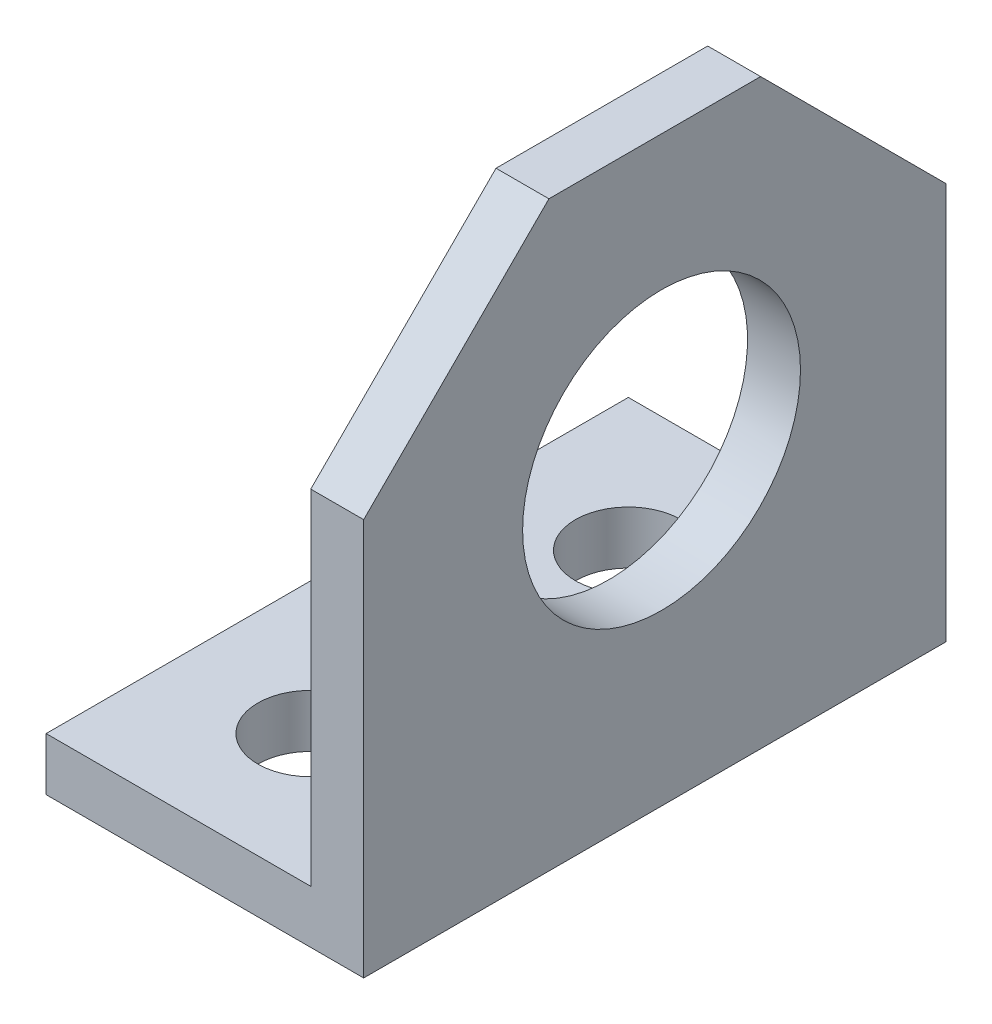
ISO-10303-21;
HEADER;
FILE_DESCRIPTION(('STEP AP214'),'2;1');
FILE_NAME('part.step','',(''),(''),'','','');
FILE_SCHEMA(('AUTOMOTIVE_DESIGN { 1 0 10303 214 1 1 1 1 }'));
ENDSEC;
DATA;
#1=APPLICATION_CONTEXT('core data for automotive mechanical design processes');
#2=APPLICATION_PROTOCOL_DEFINITION('international standard','automotive_design',2000,#1);
#3=PRODUCT_CONTEXT('',#1,'mechanical');
#4=PRODUCT('Part','Part','',(#3));
#5=PRODUCT_RELATED_PRODUCT_CATEGORY('part','',(#4));
#6=PRODUCT_DEFINITION_FORMATION('','',#4);
#7=PRODUCT_DEFINITION_CONTEXT('part definition',#1,'design');
#8=PRODUCT_DEFINITION('design','',#6,#7);
#9=PRODUCT_DEFINITION_SHAPE('','',#8);
#10=(LENGTH_UNIT() NAMED_UNIT(*) SI_UNIT(.MILLI.,.METRE.));
#11=(NAMED_UNIT(*) PLANE_ANGLE_UNIT() SI_UNIT($,.RADIAN.));
#12=(NAMED_UNIT(*) SI_UNIT($,.STERADIAN.) SOLID_ANGLE_UNIT());
#13=UNCERTAINTY_MEASURE_WITH_UNIT(LENGTH_MEASURE(1.E-05),#10,'distance_accuracy_value','');
#14=(GEOMETRIC_REPRESENTATION_CONTEXT(3) GLOBAL_UNCERTAINTY_ASSIGNED_CONTEXT((#13)) GLOBAL_UNIT_ASSIGNED_CONTEXT((#10,
#11,#12)) REPRESENTATION_CONTEXT('',''));
#15=CARTESIAN_POINT('',(0.,0.,0.));
#16=DIRECTION('',(0.,0.,1.));
#17=DIRECTION('',(1.,0.,0.));
#18=AXIS2_PLACEMENT_3D('',#15,#16,#17);
#19=CARTESIAN_POINT('',(0.,2.,11.));
#20=DIRECTION('',(0.,-1.,0.));
#21=DIRECTION('',(1.,0.,0.));
#22=AXIS2_PLACEMENT_3D('',#19,#20,#21);
#23=PLANE('',#22);
#24=CARTESIAN_POINT('',(-7.,2.,6.));
#25=DIRECTION('',(0.,1.,0.));
#26=DIRECTION('',(-1.,0.,0.));
#27=AXIS2_PLACEMENT_3D('',#24,#25,#26);
#28=CIRCLE('',#27,2.);
#29=CARTESIAN_POINT('',(-9.,2.,6.));
#30=VERTEX_POINT('',#29);
#31=EDGE_CURVE('E173',#30,#30,#28,.T.);
#32=ORIENTED_EDGE('',*,*,#31,.F.);
#33=EDGE_LOOP('',(#32));
#34=FACE_BOUND('',#33,.T.);
#35=CARTESIAN_POINT('',(-7.,2.,-6.));
#36=DIRECTION('',(0.,1.,0.));
#37=DIRECTION('',(-1.,0.,0.));
#38=AXIS2_PLACEMENT_3D('',#35,#36,#37);
#39=CIRCLE('',#38,2.);
#40=CARTESIAN_POINT('',(-9.,2.,-6.));
#41=VERTEX_POINT('',#40);
#42=EDGE_CURVE('E166',#41,#41,#39,.T.);
#43=ORIENTED_EDGE('',*,*,#42,.F.);
#44=EDGE_LOOP('',(#43));
#45=FACE_BOUND('',#44,.T.);
#46=DIRECTION('',(-1.,0.,0.));
#47=VECTOR('',#46,1.);
#48=CARTESIAN_POINT('',(0.,2.,-11.));
#49=LINE('',#48,#47);
#50=CARTESIAN_POINT('',(-2.,2.,-11.));
#51=VERTEX_POINT('',#50);
#52=CARTESIAN_POINT('',(-12.,2.,-11.));
#53=VERTEX_POINT('',#52);
#54=EDGE_CURVE('E117',#51,#53,#49,.T.);
#55=ORIENTED_EDGE('',*,*,#54,.T.);
#56=DIRECTION('',(0.,0.,-1.));
#57=VECTOR('',#56,1.);
#58=CARTESIAN_POINT('',(-12.,2.,11.));
#59=LINE('',#58,#57);
#60=CARTESIAN_POINT('',(-12.,2.,11.));
#61=VERTEX_POINT('',#60);
#62=EDGE_CURVE('E115',#61,#53,#59,.T.);
#63=ORIENTED_EDGE('',*,*,#62,.F.);
#64=DIRECTION('',(-1.,0.,0.));
#65=VECTOR('',#64,1.);
#66=CARTESIAN_POINT('',(0.,2.,11.));
#67=LINE('',#66,#65);
#68=CARTESIAN_POINT('',(-2.,2.,11.));
#69=VERTEX_POINT('',#68);
#70=EDGE_CURVE('E101',#69,#61,#67,.T.);
#71=ORIENTED_EDGE('',*,*,#70,.F.);
#72=DIRECTION('',(0.,0.,-1.));
#73=VECTOR('',#72,1.);
#74=CARTESIAN_POINT('',(-2.,2.,11.));
#75=LINE('',#74,#73);
#76=EDGE_CURVE('E133',#69,#51,#75,.T.);
#77=ORIENTED_EDGE('',*,*,#76,.T.);
#78=EDGE_LOOP('',(#55,#63,#71,#77));
#79=FACE_BOUND('',#78,.T.);
#80=ADVANCED_FACE('F34',(#34,#45,#79),#23,.F.);
#81=CARTESIAN_POINT('',(-12.,0.,11.));
#82=DIRECTION('',(-1.,0.,0.));
#83=DIRECTION('',(0.,0.,1.));
#84=AXIS2_PLACEMENT_3D('',#81,#82,#83);
#85=PLANE('',#84);
#86=DIRECTION('',(0.,1.,0.));
#87=VECTOR('',#86,1.);
#88=CARTESIAN_POINT('',(-12.,0.,-11.));
#89=LINE('',#88,#87);
#90=CARTESIAN_POINT('',(-12.,0.,-11.));
#91=VERTEX_POINT('',#90);
#92=EDGE_CURVE('E135',#91,#53,#89,.T.);
#93=ORIENTED_EDGE('',*,*,#92,.F.);
#94=DIRECTION('',(0.,0.,-1.));
#95=VECTOR('',#94,1.);
#96=CARTESIAN_POINT('',(-12.,0.,11.));
#97=LINE('',#96,#95);
#98=CARTESIAN_POINT('',(-12.,0.,11.));
#99=VERTEX_POINT('',#98);
#100=EDGE_CURVE('E122',#99,#91,#97,.T.);
#101=ORIENTED_EDGE('',*,*,#100,.F.);
#102=DIRECTION('',(0.,1.,0.));
#103=VECTOR('',#102,1.);
#104=CARTESIAN_POINT('',(-12.,0.,11.));
#105=LINE('',#104,#103);
#106=EDGE_CURVE('E106',#99,#61,#105,.T.);
#107=ORIENTED_EDGE('',*,*,#106,.T.);
#108=ORIENTED_EDGE('',*,*,#62,.T.);
#109=EDGE_LOOP('',(#93,#101,#107,#108));
#110=FACE_BOUND('',#109,.T.);
#111=ADVANCED_FACE('F124',(#110),#85,.T.);
#112=CARTESIAN_POINT('',(0.,0.,11.));
#113=DIRECTION('',(0.,-1.,0.));
#114=DIRECTION('',(1.,0.,0.));
#115=AXIS2_PLACEMENT_3D('',#112,#113,#114);
#116=PLANE('',#115);
#117=CARTESIAN_POINT('',(-7.,0.,6.));
#118=DIRECTION('',(0.,-1.,0.));
#119=DIRECTION('',(1.,0.,0.));
#120=AXIS2_PLACEMENT_3D('',#117,#118,#119);
#121=CIRCLE('',#120,2.);
#122=CARTESIAN_POINT('',(-9.,0.,6.));
#123=VERTEX_POINT('',#122);
#124=EDGE_CURVE('E38',#123,#123,#121,.T.);
#125=ORIENTED_EDGE('',*,*,#124,.F.);
#126=EDGE_LOOP('',(#125));
#127=FACE_BOUND('',#126,.T.);
#128=CARTESIAN_POINT('',(-7.,0.,-6.));
#129=DIRECTION('',(0.,-1.,0.));
#130=DIRECTION('',(1.,0.,0.));
#131=AXIS2_PLACEMENT_3D('',#128,#129,#130);
#132=CIRCLE('',#131,2.);
#133=CARTESIAN_POINT('',(-9.,0.,-6.));
#134=VERTEX_POINT('',#133);
#135=EDGE_CURVE('E136',#134,#134,#132,.T.);
#136=ORIENTED_EDGE('',*,*,#135,.F.);
#137=EDGE_LOOP('',(#136));
#138=FACE_BOUND('',#137,.T.);
#139=DIRECTION('',(-1.,0.,0.));
#140=VECTOR('',#139,1.);
#141=CARTESIAN_POINT('',(0.,0.,-11.));
#142=LINE('',#141,#140);
#143=CARTESIAN_POINT('',(0.,0.,-11.));
#144=VERTEX_POINT('',#143);
#145=EDGE_CURVE('E138',#144,#91,#142,.T.);
#146=ORIENTED_EDGE('',*,*,#145,.F.);
#147=DIRECTION('',(0.,0.,-1.));
#148=VECTOR('',#147,1.);
#149=CARTESIAN_POINT('',(0.,0.,11.));
#150=LINE('',#149,#148);
#151=CARTESIAN_POINT('',(0.,0.,11.));
#152=VERTEX_POINT('',#151);
#153=EDGE_CURVE('E149',#152,#144,#150,.T.);
#154=ORIENTED_EDGE('',*,*,#153,.F.);
#155=DIRECTION('',(-1.,0.,0.));
#156=VECTOR('',#155,1.);
#157=CARTESIAN_POINT('',(0.,0.,11.));
#158=LINE('',#157,#156);
#159=EDGE_CURVE('E125',#152,#99,#158,.T.);
#160=ORIENTED_EDGE('',*,*,#159,.T.);
#161=ORIENTED_EDGE('',*,*,#100,.T.);
#162=EDGE_LOOP('',(#146,#154,#160,#161));
#163=FACE_BOUND('',#162,.T.);
#164=ADVANCED_FACE('F207',(#127,#138,#163),#116,.T.);
#165=CARTESIAN_POINT('',(0.,0.,11.));
#166=DIRECTION('',(1.,0.,0.));
#167=DIRECTION('',(0.,0.,-1.));
#168=AXIS2_PLACEMENT_3D('',#165,#166,#167);
#169=PLANE('',#168);
#170=CARTESIAN_POINT('',(0.,11.64843331,-0.255547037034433));
#171=DIRECTION('',(1.,0.,0.));
#172=DIRECTION('',(0.,0.,-1.));
#173=AXIS2_PLACEMENT_3D('',#170,#171,#172);
#174=CIRCLE('',#173,5.25);
#175=CARTESIAN_POINT('',(0.,11.64843331,-5.50554703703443));
#176=VERTEX_POINT('',#175);
#177=EDGE_CURVE('E177',#176,#176,#174,.T.);
#178=ORIENTED_EDGE('',*,*,#177,.F.);
#179=EDGE_LOOP('',(#178));
#180=FACE_BOUND('',#179,.T.);
#181=DIRECTION('',(0.,-1.,0.));
#182=VECTOR('',#181,1.);
#183=CARTESIAN_POINT('',(0.,0.,-11.));
#184=LINE('',#183,#182);
#185=CARTESIAN_POINT('',(0.,15.,-11.));
#186=VERTEX_POINT('',#185);
#187=EDGE_CURVE('E141',#186,#144,#184,.T.);
#188=ORIENTED_EDGE('',*,*,#187,.F.);
#189=DIRECTION('',(0.,-0.707106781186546,-0.707106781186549));
#190=VECTOR('',#189,1.);
#191=CARTESIAN_POINT('',(0.,18.5,-7.49999999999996));
#192=LINE('',#191,#190);
#193=CARTESIAN_POINT('',(0.,22.,-3.99999999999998));
#194=VERTEX_POINT('',#193);
#195=EDGE_CURVE('E157',#186,#194,#192,.F.);
#196=ORIENTED_EDGE('',*,*,#195,.T.);
#197=DIRECTION('',(0.,0.,-1.));
#198=VECTOR('',#197,1.);
#199=CARTESIAN_POINT('',(0.,22.,11.));
#200=LINE('',#199,#198);
#201=CARTESIAN_POINT('',(0.,22.,4.00000000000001));
#202=VERTEX_POINT('',#201);
#203=EDGE_CURVE('E147',#202,#194,#200,.T.);
#204=ORIENTED_EDGE('',*,*,#203,.F.);
#205=DIRECTION('',(0.,-0.707106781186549,0.707106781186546));
#206=VECTOR('',#205,1.);
#207=CARTESIAN_POINT('',(0.,7.49999999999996,18.5));
#208=LINE('',#207,#206);
#209=CARTESIAN_POINT('',(0.,15.,11.));
#210=VERTEX_POINT('',#209);
#211=EDGE_CURVE('E155',#202,#210,#208,.T.);
#212=ORIENTED_EDGE('',*,*,#211,.T.);
#213=DIRECTION('',(0.,-1.,0.));
#214=VECTOR('',#213,1.);
#215=CARTESIAN_POINT('',(0.,0.,11.));
#216=LINE('',#215,#214);
#217=EDGE_CURVE('E127',#210,#152,#216,.T.);
#218=ORIENTED_EDGE('',*,*,#217,.T.);
#219=ORIENTED_EDGE('',*,*,#153,.T.);
#220=EDGE_LOOP('',(#188,#196,#204,#212,#218,#219));
#221=FACE_BOUND('',#220,.T.);
#222=ADVANCED_FACE('F202',(#180,#221),#169,.T.);
#223=CARTESIAN_POINT('',(-2.,22.,11.));
#224=DIRECTION('',(0.,1.,0.));
#225=DIRECTION('',(0.,0.,1.));
#226=AXIS2_PLACEMENT_3D('',#223,#224,#225);
#227=PLANE('',#226);
#228=ORIENTED_EDGE('',*,*,#203,.T.);
#229=DIRECTION('',(-1.,0.,0.));
#230=VECTOR('',#229,1.);
#231=CARTESIAN_POINT('',(-2.,22.,-3.99999999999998));
#232=LINE('',#231,#230);
#233=CARTESIAN_POINT('',(-2.,22.,-3.99999999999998));
#234=VERTEX_POINT('',#233);
#235=EDGE_CURVE('E57',#194,#234,#232,.T.);
#236=ORIENTED_EDGE('',*,*,#235,.T.);
#237=DIRECTION('',(0.,0.,-1.));
#238=VECTOR('',#237,1.);
#239=CARTESIAN_POINT('',(-2.,22.,11.));
#240=LINE('',#239,#238);
#241=CARTESIAN_POINT('',(-2.,22.,4.00000000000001));
#242=VERTEX_POINT('',#241);
#243=EDGE_CURVE('E145',#242,#234,#240,.T.);
#244=ORIENTED_EDGE('',*,*,#243,.F.);
#245=DIRECTION('',(1.,0.,0.));
#246=VECTOR('',#245,1.);
#247=CARTESIAN_POINT('',(0.,22.,4.));
#248=LINE('',#247,#246);
#249=EDGE_CURVE('E159',#242,#202,#248,.T.);
#250=ORIENTED_EDGE('',*,*,#249,.T.);
#251=EDGE_LOOP('',(#228,#236,#244,#250));
#252=FACE_BOUND('',#251,.T.);
#253=ADVANCED_FACE('F189',(#252),#227,.T.);
#254=CARTESIAN_POINT('',(-2.,0.,11.));
#255=DIRECTION('',(1.,0.,0.));
#256=DIRECTION('',(0.,0.,-1.));
#257=AXIS2_PLACEMENT_3D('',#254,#255,#256);
#258=PLANE('',#257);
#259=CARTESIAN_POINT('',(-2.,11.64843331,-0.255547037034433));
#260=DIRECTION('',(-1.,0.,0.));
#261=DIRECTION('',(0.,0.,1.));
#262=AXIS2_PLACEMENT_3D('',#259,#260,#261);
#263=CIRCLE('',#262,5.25);
#264=CARTESIAN_POINT('',(-2.,11.64843331,4.99445296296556));
#265=VERTEX_POINT('',#264);
#266=EDGE_CURVE('E180',#265,#265,#263,.T.);
#267=ORIENTED_EDGE('',*,*,#266,.F.);
#268=EDGE_LOOP('',(#267));
#269=FACE_BOUND('',#268,.T.);
#270=ORIENTED_EDGE('',*,*,#243,.T.);
#271=DIRECTION('',(0.,0.707106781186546,0.707106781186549));
#272=VECTOR('',#271,1.);
#273=CARTESIAN_POINT('',(-2.,15.,-11.));
#274=LINE('',#273,#272);
#275=CARTESIAN_POINT('',(-2.,15.,-11.));
#276=VERTEX_POINT('',#275);
#277=EDGE_CURVE('E43',#234,#276,#274,.F.);
#278=ORIENTED_EDGE('',*,*,#277,.T.);
#279=DIRECTION('',(0.,1.,0.));
#280=VECTOR('',#279,1.);
#281=CARTESIAN_POINT('',(-2.,0.,-11.));
#282=LINE('',#281,#280);
#283=EDGE_CURVE('E112',#276,#51,#282,.F.);
#284=ORIENTED_EDGE('',*,*,#283,.T.);
#285=ORIENTED_EDGE('',*,*,#76,.F.);
#286=DIRECTION('',(0.,1.,0.));
#287=VECTOR('',#286,1.);
#288=CARTESIAN_POINT('',(-2.,0.,11.));
#289=LINE('',#288,#287);
#290=CARTESIAN_POINT('',(-2.,15.,11.));
#291=VERTEX_POINT('',#290);
#292=EDGE_CURVE('E108',#291,#69,#289,.F.);
#293=ORIENTED_EDGE('',*,*,#292,.F.);
#294=DIRECTION('',(0.,0.707106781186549,-0.707106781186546));
#295=VECTOR('',#294,1.);
#296=CARTESIAN_POINT('',(-2.,22.,4.));
#297=LINE('',#296,#295);
#298=EDGE_CURVE('E163',#291,#242,#297,.T.);
#299=ORIENTED_EDGE('',*,*,#298,.T.);
#300=EDGE_LOOP('',(#270,#278,#284,#285,#293,#299));
#301=FACE_BOUND('',#300,.T.);
#302=ADVANCED_FACE('F186',(#269,#301),#258,.F.);
#303=CARTESIAN_POINT('',(-12.,2.,11.));
#304=DIRECTION('',(0.,0.,-1.));
#305=DIRECTION('',(-1.,0.,0.));
#306=AXIS2_PLACEMENT_3D('',#303,#304,#305);
#307=PLANE('',#306);
#308=ORIENTED_EDGE('',*,*,#217,.F.);
#309=DIRECTION('',(-1.,0.,0.));
#310=VECTOR('',#309,1.);
#311=CARTESIAN_POINT('',(-2.,15.,11.));
#312=LINE('',#311,#310);
#313=EDGE_CURVE('E11',#210,#291,#312,.T.);
#314=ORIENTED_EDGE('',*,*,#313,.T.);
#315=ORIENTED_EDGE('',*,*,#292,.T.);
#316=ORIENTED_EDGE('',*,*,#70,.T.);
#317=ORIENTED_EDGE('',*,*,#106,.F.);
#318=ORIENTED_EDGE('',*,*,#159,.F.);
#319=EDGE_LOOP('',(#308,#314,#315,#316,#317,#318));
#320=FACE_BOUND('',#319,.T.);
#321=ADVANCED_FACE('F103',(#320),#307,.F.);
#322=CARTESIAN_POINT('',(-12.,2.,-11.));
#323=DIRECTION('',(0.,0.,-1.));
#324=DIRECTION('',(-1.,0.,0.));
#325=AXIS2_PLACEMENT_3D('',#322,#323,#324);
#326=PLANE('',#325);
#327=ORIENTED_EDGE('',*,*,#283,.F.);
#328=DIRECTION('',(1.,0.,0.));
#329=VECTOR('',#328,1.);
#330=CARTESIAN_POINT('',(-12.,15.,-11.));
#331=LINE('',#330,#329);
#332=EDGE_CURVE('E121',#276,#186,#331,.T.);
#333=ORIENTED_EDGE('',*,*,#332,.T.);
#334=ORIENTED_EDGE('',*,*,#187,.T.);
#335=ORIENTED_EDGE('',*,*,#145,.T.);
#336=ORIENTED_EDGE('',*,*,#92,.T.);
#337=ORIENTED_EDGE('',*,*,#54,.F.);
#338=EDGE_LOOP('',(#327,#333,#334,#335,#336,#337));
#339=FACE_BOUND('',#338,.T.);
#340=ADVANCED_FACE('F200',(#339),#326,.T.);
#341=CARTESIAN_POINT('',(-12.,15.,-11.));
#342=DIRECTION('',(0.,-0.707106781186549,0.707106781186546));
#343=DIRECTION('',(0.,-0.707106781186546,-0.707106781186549));
#344=AXIS2_PLACEMENT_3D('',#341,#342,#343);
#345=PLANE('',#344);
#346=ORIENTED_EDGE('',*,*,#277,.F.);
#347=ORIENTED_EDGE('',*,*,#235,.F.);
#348=ORIENTED_EDGE('',*,*,#195,.F.);
#349=ORIENTED_EDGE('',*,*,#332,.F.);
#350=EDGE_LOOP('',(#346,#347,#348,#349));
#351=FACE_BOUND('',#350,.T.);
#352=ADVANCED_FACE('F197',(#351),#345,.F.);
#353=CARTESIAN_POINT('',(-2.,22.,4.));
#354=DIRECTION('',(0.,0.707106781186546,0.707106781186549));
#355=DIRECTION('',(0.,-0.707106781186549,0.707106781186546));
#356=AXIS2_PLACEMENT_3D('',#353,#354,#355);
#357=PLANE('',#356);
#358=ORIENTED_EDGE('',*,*,#298,.F.);
#359=ORIENTED_EDGE('',*,*,#313,.F.);
#360=ORIENTED_EDGE('',*,*,#211,.F.);
#361=ORIENTED_EDGE('',*,*,#249,.F.);
#362=EDGE_LOOP('',(#358,#359,#360,#361));
#363=FACE_BOUND('',#362,.T.);
#364=ADVANCED_FACE('F36',(#363),#357,.T.);
#365=CARTESIAN_POINT('',(-7.,-8.5,-6.));
#366=DIRECTION('',(0.,1.,0.));
#367=DIRECTION('',(-1.,0.,0.));
#368=AXIS2_PLACEMENT_3D('',#365,#366,#367);
#369=CYLINDRICAL_SURFACE('',#368,2.);
#370=CARTESIAN_POINT('',(-9.,0.,-6.));
#371=CARTESIAN_POINT('',(-9.,0.0208333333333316,-6.));
#372=CARTESIAN_POINT('',(-9.,0.041666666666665,-6.));
#373=CARTESIAN_POINT('',(-9.,0.0833333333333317,-6.));
#374=CARTESIAN_POINT('',(-9.,0.104166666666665,-6.));
#375=CARTESIAN_POINT('',(-9.,0.145833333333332,-6.));
#376=CARTESIAN_POINT('',(-9.,0.166666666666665,-6.));
#377=CARTESIAN_POINT('',(-9.,0.208333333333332,-6.));
#378=CARTESIAN_POINT('',(-9.,0.229166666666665,-6.));
#379=CARTESIAN_POINT('',(-9.,0.270833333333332,-6.));
#380=CARTESIAN_POINT('',(-9.,0.291666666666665,-6.));
#381=CARTESIAN_POINT('',(-9.,0.333333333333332,-6.));
#382=CARTESIAN_POINT('',(-9.,0.354166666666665,-6.));
#383=CARTESIAN_POINT('',(-9.,0.395833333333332,-6.));
#384=CARTESIAN_POINT('',(-9.,0.416666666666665,-6.));
#385=CARTESIAN_POINT('',(-9.,0.458333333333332,-6.));
#386=CARTESIAN_POINT('',(-9.,0.479166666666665,-6.));
#387=CARTESIAN_POINT('',(-9.,0.520833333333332,-6.));
#388=CARTESIAN_POINT('',(-9.,0.541666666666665,-6.));
#389=CARTESIAN_POINT('',(-9.,0.583333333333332,-6.));
#390=CARTESIAN_POINT('',(-9.,0.604166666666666,-6.));
#391=CARTESIAN_POINT('',(-9.,0.645833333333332,-6.));
#392=CARTESIAN_POINT('',(-9.,0.666666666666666,-6.));
#393=CARTESIAN_POINT('',(-9.,0.708333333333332,-6.));
#394=CARTESIAN_POINT('',(-9.,0.729166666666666,-6.));
#395=CARTESIAN_POINT('',(-9.,0.770833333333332,-6.));
#396=CARTESIAN_POINT('',(-9.,0.791666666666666,-6.));
#397=CARTESIAN_POINT('',(-9.,0.833333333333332,-6.));
#398=CARTESIAN_POINT('',(-9.,0.854166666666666,-6.));
#399=CARTESIAN_POINT('',(-9.,0.895833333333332,-6.));
#400=CARTESIAN_POINT('',(-9.,0.916666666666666,-6.));
#401=CARTESIAN_POINT('',(-9.,0.958333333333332,-6.));
#402=CARTESIAN_POINT('',(-9.,0.979166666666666,-6.));
#403=CARTESIAN_POINT('',(-9.,1.02083333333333,-6.));
#404=CARTESIAN_POINT('',(-9.,1.04166666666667,-6.));
#405=CARTESIAN_POINT('',(-9.,1.08333333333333,-6.));
#406=CARTESIAN_POINT('',(-9.,1.10416666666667,-6.));
#407=CARTESIAN_POINT('',(-9.,1.14583333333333,-6.));
#408=CARTESIAN_POINT('',(-9.,1.16666666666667,-6.));
#409=CARTESIAN_POINT('',(-9.,1.20833333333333,-6.));
#410=CARTESIAN_POINT('',(-9.,1.22916666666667,-6.));
#411=CARTESIAN_POINT('',(-9.,1.27083333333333,-6.));
#412=CARTESIAN_POINT('',(-9.,1.29166666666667,-6.));
#413=CARTESIAN_POINT('',(-9.,1.33333333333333,-6.));
#414=CARTESIAN_POINT('',(-9.,1.35416666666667,-6.));
#415=CARTESIAN_POINT('',(-9.,1.39583333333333,-6.));
#416=CARTESIAN_POINT('',(-9.,1.41666666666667,-6.));
#417=CARTESIAN_POINT('',(-9.,1.45833333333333,-6.));
#418=CARTESIAN_POINT('',(-9.,1.47916666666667,-6.));
#419=CARTESIAN_POINT('',(-9.,1.52083333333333,-6.));
#420=CARTESIAN_POINT('',(-9.,1.54166666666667,-6.));
#421=CARTESIAN_POINT('',(-9.,1.58333333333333,-6.));
#422=CARTESIAN_POINT('',(-9.,1.60416666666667,-6.));
#423=CARTESIAN_POINT('',(-9.,1.64583333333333,-6.));
#424=CARTESIAN_POINT('',(-9.,1.66666666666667,-6.));
#425=CARTESIAN_POINT('',(-9.,1.70833333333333,-6.));
#426=CARTESIAN_POINT('',(-9.,1.72916666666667,-6.));
#427=CARTESIAN_POINT('',(-9.,1.77083333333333,-6.));
#428=CARTESIAN_POINT('',(-9.,1.79166666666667,-6.));
#429=CARTESIAN_POINT('',(-9.,1.83333333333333,-6.));
#430=CARTESIAN_POINT('',(-9.,1.85416666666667,-6.));
#431=CARTESIAN_POINT('',(-9.,1.89583333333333,-6.));
#432=CARTESIAN_POINT('',(-9.,1.91666666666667,-6.));
#433=CARTESIAN_POINT('',(-9.,1.95833333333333,-6.));
#434=CARTESIAN_POINT('',(-9.,1.97916666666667,-6.));
#435=CARTESIAN_POINT('',(-9.,2.,-6.));
#436=B_SPLINE_CURVE_WITH_KNOTS('',3,(#370,#371,#372,#373,#374,#375,#376,#377,#378,#379,#380,
#381,#382,#383,#384,#385,#386,#387,#388,#389,#390,#391,#392,#393,#394,#395,#396,#397,#398,#399,
#400,#401,#402,#403,#404,#405,#406,#407,#408,#409,#410,#411,#412,#413,#414,#415,#416,#417,#418,
#419,#420,#421,#422,#423,#424,#425,#426,#427,#428,#429,#430,#431,#432,#433,#434,#435),
.UNSPECIFIED.,.F.,.F.,(4,2,2,2,2,2,2,2,2,2,2,2,2,2,2,2,2,2,2,2,2,2,2,2,2,2,2,2,2,2,2,2,4),(0.,
0.0625000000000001,0.125,0.1875,0.25,0.3125,0.375,0.4375,0.5,0.5625,0.625000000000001,
0.687500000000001,0.750000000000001,0.812500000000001,0.875000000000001,0.937500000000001,1.,
1.0625,1.125,1.1875,1.25,1.3125,1.375,1.4375,1.5,1.5625,1.625,1.6875,1.75,1.8125,1.875,1.9375,
2.),.UNSPECIFIED.);
#437=EDGE_CURVE('BSEAM231',#134,#41,#436,.T.);
#438=ORIENTED_EDGE('',*,*,#135,.T.);
#439=ORIENTED_EDGE('',*,*,#42,.T.);
#440=ORIENTED_EDGE('',*,*,#437,.T.);
#441=ORIENTED_EDGE('',*,*,#437,.F.);
#442=EDGE_LOOP('',(#438,#440,#439,#441));
#443=FACE_BOUND('',#442,.T.);
#444=ADVANCED_FACE('F231',(#443),#369,.F.);
#445=CARTESIAN_POINT('',(-7.,-8.5,6.));
#446=DIRECTION('',(0.,1.,0.));
#447=DIRECTION('',(-1.,0.,0.));
#448=AXIS2_PLACEMENT_3D('',#445,#446,#447);
#449=CYLINDRICAL_SURFACE('',#448,2.);
#450=CARTESIAN_POINT('',(-9.,0.,6.));
#451=CARTESIAN_POINT('',(-9.,0.0208333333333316,6.));
#452=CARTESIAN_POINT('',(-9.,0.041666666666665,6.));
#453=CARTESIAN_POINT('',(-9.,0.0833333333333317,6.));
#454=CARTESIAN_POINT('',(-9.,0.104166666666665,6.));
#455=CARTESIAN_POINT('',(-9.,0.145833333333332,6.));
#456=CARTESIAN_POINT('',(-9.,0.166666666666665,6.));
#457=CARTESIAN_POINT('',(-9.,0.208333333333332,6.));
#458=CARTESIAN_POINT('',(-9.,0.229166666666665,6.));
#459=CARTESIAN_POINT('',(-9.,0.270833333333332,6.));
#460=CARTESIAN_POINT('',(-9.,0.291666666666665,6.));
#461=CARTESIAN_POINT('',(-9.,0.333333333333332,6.));
#462=CARTESIAN_POINT('',(-9.,0.354166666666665,6.));
#463=CARTESIAN_POINT('',(-9.,0.395833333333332,6.));
#464=CARTESIAN_POINT('',(-9.,0.416666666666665,6.));
#465=CARTESIAN_POINT('',(-9.,0.458333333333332,6.));
#466=CARTESIAN_POINT('',(-9.,0.479166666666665,6.));
#467=CARTESIAN_POINT('',(-9.,0.520833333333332,6.));
#468=CARTESIAN_POINT('',(-9.,0.541666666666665,6.));
#469=CARTESIAN_POINT('',(-9.,0.583333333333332,6.));
#470=CARTESIAN_POINT('',(-9.,0.604166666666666,6.));
#471=CARTESIAN_POINT('',(-9.,0.645833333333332,6.));
#472=CARTESIAN_POINT('',(-9.,0.666666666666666,6.));
#473=CARTESIAN_POINT('',(-9.,0.708333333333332,6.));
#474=CARTESIAN_POINT('',(-9.,0.729166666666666,6.));
#475=CARTESIAN_POINT('',(-9.,0.770833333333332,6.));
#476=CARTESIAN_POINT('',(-9.,0.791666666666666,6.));
#477=CARTESIAN_POINT('',(-9.,0.833333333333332,6.));
#478=CARTESIAN_POINT('',(-9.,0.854166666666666,6.));
#479=CARTESIAN_POINT('',(-9.,0.895833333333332,6.));
#480=CARTESIAN_POINT('',(-9.,0.916666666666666,6.));
#481=CARTESIAN_POINT('',(-9.,0.958333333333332,6.));
#482=CARTESIAN_POINT('',(-9.,0.979166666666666,6.));
#483=CARTESIAN_POINT('',(-9.,1.02083333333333,6.));
#484=CARTESIAN_POINT('',(-9.,1.04166666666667,6.));
#485=CARTESIAN_POINT('',(-9.,1.08333333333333,6.));
#486=CARTESIAN_POINT('',(-9.,1.10416666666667,6.));
#487=CARTESIAN_POINT('',(-9.,1.14583333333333,6.));
#488=CARTESIAN_POINT('',(-9.,1.16666666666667,6.));
#489=CARTESIAN_POINT('',(-9.,1.20833333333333,6.));
#490=CARTESIAN_POINT('',(-9.,1.22916666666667,6.));
#491=CARTESIAN_POINT('',(-9.,1.27083333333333,6.));
#492=CARTESIAN_POINT('',(-9.,1.29166666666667,6.));
#493=CARTESIAN_POINT('',(-9.,1.33333333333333,6.));
#494=CARTESIAN_POINT('',(-9.,1.35416666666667,6.));
#495=CARTESIAN_POINT('',(-9.,1.39583333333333,6.));
#496=CARTESIAN_POINT('',(-9.,1.41666666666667,6.));
#497=CARTESIAN_POINT('',(-9.,1.45833333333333,6.));
#498=CARTESIAN_POINT('',(-9.,1.47916666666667,6.));
#499=CARTESIAN_POINT('',(-9.,1.52083333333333,6.));
#500=CARTESIAN_POINT('',(-9.,1.54166666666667,6.));
#501=CARTESIAN_POINT('',(-9.,1.58333333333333,6.));
#502=CARTESIAN_POINT('',(-9.,1.60416666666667,6.));
#503=CARTESIAN_POINT('',(-9.,1.64583333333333,6.));
#504=CARTESIAN_POINT('',(-9.,1.66666666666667,6.));
#505=CARTESIAN_POINT('',(-9.,1.70833333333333,6.));
#506=CARTESIAN_POINT('',(-9.,1.72916666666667,6.));
#507=CARTESIAN_POINT('',(-9.,1.77083333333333,6.));
#508=CARTESIAN_POINT('',(-9.,1.79166666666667,6.));
#509=CARTESIAN_POINT('',(-9.,1.83333333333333,6.));
#510=CARTESIAN_POINT('',(-9.,1.85416666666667,6.));
#511=CARTESIAN_POINT('',(-9.,1.89583333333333,6.));
#512=CARTESIAN_POINT('',(-9.,1.91666666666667,6.));
#513=CARTESIAN_POINT('',(-9.,1.95833333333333,6.));
#514=CARTESIAN_POINT('',(-9.,1.97916666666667,6.));
#515=CARTESIAN_POINT('',(-9.,2.,6.));
#516=B_SPLINE_CURVE_WITH_KNOTS('',3,(#450,#451,#452,#453,#454,#455,#456,#457,#458,#459,#460,
#461,#462,#463,#464,#465,#466,#467,#468,#469,#470,#471,#472,#473,#474,#475,#476,#477,#478,#479,
#480,#481,#482,#483,#484,#485,#486,#487,#488,#489,#490,#491,#492,#493,#494,#495,#496,#497,#498,
#499,#500,#501,#502,#503,#504,#505,#506,#507,#508,#509,#510,#511,#512,#513,#514,#515),
.UNSPECIFIED.,.F.,.F.,(4,2,2,2,2,2,2,2,2,2,2,2,2,2,2,2,2,2,2,2,2,2,2,2,2,2,2,2,2,2,2,2,4),(0.,
0.0625000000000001,0.125,0.1875,0.25,0.3125,0.375,0.4375,0.5,0.5625,0.625000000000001,
0.687500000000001,0.750000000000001,0.812500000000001,0.875000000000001,0.937500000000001,1.,
1.0625,1.125,1.1875,1.25,1.3125,1.375,1.4375,1.5,1.5625,1.625,1.6875,1.75,1.8125,1.875,1.9375,
2.),.UNSPECIFIED.);
#517=EDGE_CURVE('BSEAM240',#123,#30,#516,.T.);
#518=ORIENTED_EDGE('',*,*,#124,.T.);
#519=ORIENTED_EDGE('',*,*,#31,.T.);
#520=ORIENTED_EDGE('',*,*,#517,.T.);
#521=ORIENTED_EDGE('',*,*,#517,.F.);
#522=EDGE_LOOP('',(#518,#520,#519,#521));
#523=FACE_BOUND('',#522,.T.);
#524=ADVANCED_FACE('F240',(#523),#449,.F.);
#525=CARTESIAN_POINT('',(8.,11.64843331,-0.255547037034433));
#526=DIRECTION('',(-1.,0.,0.));
#527=DIRECTION('',(0.,0.,1.));
#528=AXIS2_PLACEMENT_3D('',#525,#526,#527);
#529=CYLINDRICAL_SURFACE('',#528,5.25);
#530=ORIENTED_EDGE('',*,*,#177,.T.);
#531=EDGE_LOOP('',(#530));
#532=FACE_BOUND('',#531,.T.);
#533=ORIENTED_EDGE('',*,*,#266,.T.);
#534=EDGE_LOOP('',(#533));
#535=FACE_BOUND('',#534,.T.);
#536=ADVANCED_FACE('F184',(#532,#535),#529,.F.);
#537=CLOSED_SHELL('',(#80,#111,#164,#222,#253,#302,#321,#340,#352,#364,#444,#524,#536));
#538=MANIFOLD_SOLID_BREP('B2',#537);
#539=ADVANCED_BREP_SHAPE_REPRESENTATION('',(#18,#538),#14);
#540=SHAPE_DEFINITION_REPRESENTATION(#9,#539);
ENDSEC;
END-ISO-10303-21;
